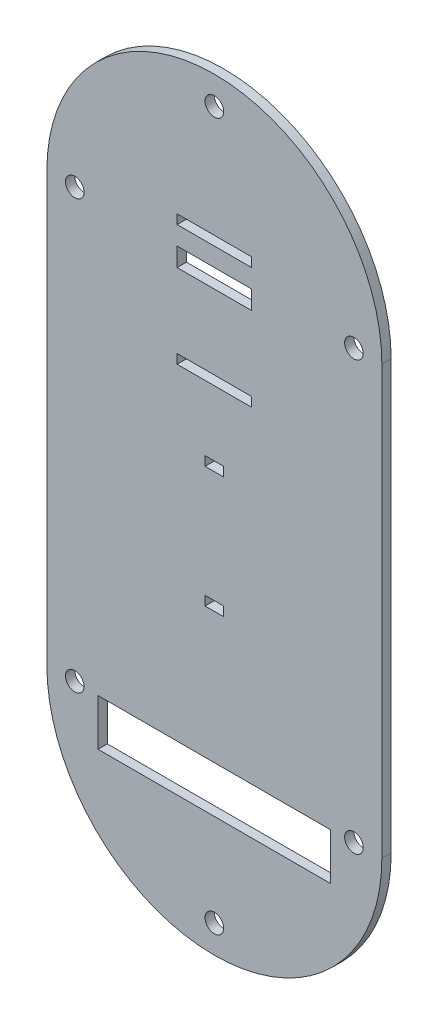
from build123d import *

# Parameters (mm, degrees)
SKETCH1_R           = 3.175
SKETCH1_W           = 25.4
SKETCH1_H           = 6.35
SKETCH1_W_2         = 6.35
SKETCH1_H_2         = 3.175
SKETCH1_W_3         = 79.375
SKETCH1_H_3         = 15.875
BOSS_EXTRUDE1_DEPTH = 3.175


with BuildPart() as part:
    # Sketch1 → Boss-Extrude1 (new body)
    with BuildSketch(Plane.XY):
        with BuildLine():
            Line((-20.500160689, 34.511738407), (-20.500160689, -111.538261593))
            ThreePointArc((-20.500160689, -111.538261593), (36.649839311, -168.688261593), (93.799839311, -111.538261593))
            Line((93.799839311, -111.538261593), (93.799839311, 34.511738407))
            ThreePointArc((93.799839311, 34.511738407), (36.649839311, 91.661738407), (-20.500160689, 34.511738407))
        make_face()
        with Locations((36.649839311, 82.136738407)):
            Circle(SKETCH1_R, mode=Mode.SUBTRACT)
        with Locations((84.274839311, 34.511738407)):
            Circle(SKETCH1_R, mode=Mode.SUBTRACT)
        with Locations((-10.975160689, 34.511738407)):
            Circle(SKETCH1_R, mode=Mode.SUBTRACT)
        with Locations((-10.975160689, -111.538261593)):
            Circle(SKETCH1_R, mode=Mode.SUBTRACT)
        with Locations((84.274839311, -111.538261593)):
            Circle(SKETCH1_R, mode=Mode.SUBTRACT)
        with Locations((36.649839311, -159.163261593)):
            Circle(SKETCH1_R, mode=Mode.SUBTRACT)
        with Locations((36.649839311, 31.336738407)):
            Rectangle(SKETCH1_W, SKETCH1_H, mode=Mode.SUBTRACT)
        with Locations((36.649839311, -24.225761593)):
            Rectangle(SKETCH1_W_2, SKETCH1_H_2, mode=Mode.SUBTRACT)
        with Locations((36.649839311, -65.500761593)):
            Rectangle(SKETCH1_W_2, SKETCH1_H_2, mode=Mode.SUBTRACT)
        with Locations((36.649839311, 42.449238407)):
            Rectangle(SKETCH1_W, SKETCH1_H_2, mode=Mode.SUBTRACT)
        with Locations((36.649839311, 1.174238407)):
            Rectangle(SKETCH1_W, SKETCH1_H_2, mode=Mode.SUBTRACT)
        with Locations((36.649839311, -119.728836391)):
            Rectangle(SKETCH1_W_3, SKETCH1_H_3, mode=Mode.SUBTRACT)
    extrude(amount=BOSS_EXTRUDE1_DEPTH)


solid = part.part
